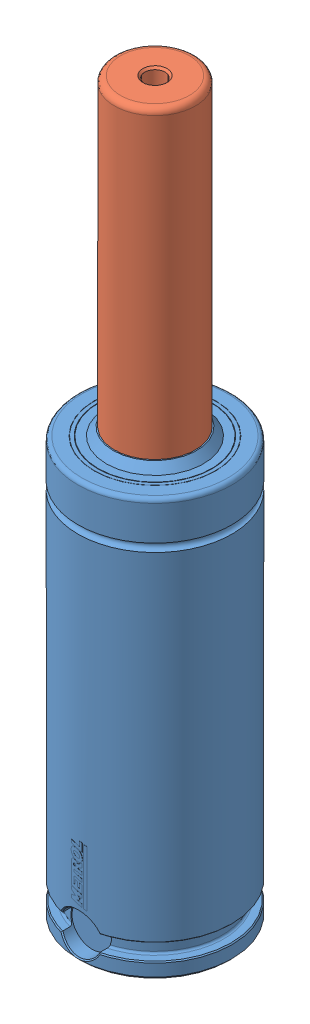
SolidWorks assembly EX0500-075.SLDASM, configuration Default (file format 7000). Lengths in mm.
Overall size (38 180 38.1).
2 component instances, 2 part files, 5 mates.
Components (placement in the parent):
- EX0500 Body-1: EX0500 Body.SLDPRT [EX-500-075] x (0 0 1) z (0 -1 0) size (38.1 38 105)
- EX-500 Piston-1: EX-500 Piston.SLDPRT [EX-500-075] at (0 88 0) x (0.996692 0 0.081276) z (0 -1 0) size (30 30 92)
Mates (geometry in assembly coordinates):
- Concentric1: concentric aligned: cylinder of EX0500 Body-1 through (0 0 0) axis (0 -1 0) radius 10; cylinder of EX-500 Piston-1 through (0 88 0) axis (0 -1 0) radius 10
- LimitDistance1: limit distance anti-aligned: plane of EX-500 Piston-1 through (-1.2191 93 14.9504) normal (0 1 0); plane of EX0500 Body-1 through (0 93 0) normal (0 -1 0)
- Coincident1: coincident anti-aligned: plane of EX0500 Body-1 through (0 0 0) normal (0 -1 0); plane of assembly through (0 0 0) normal (0 1 0)
- Coincident2: coincident anti-aligned: plane of EX0500 Body-1; plane of assembly through (0 0 0) normal (1 0 0)
- Coincident4: coincident aligned: plane of EX0500 Body-1; plane of assembly through (0 0 0) normal (0 0 1)
